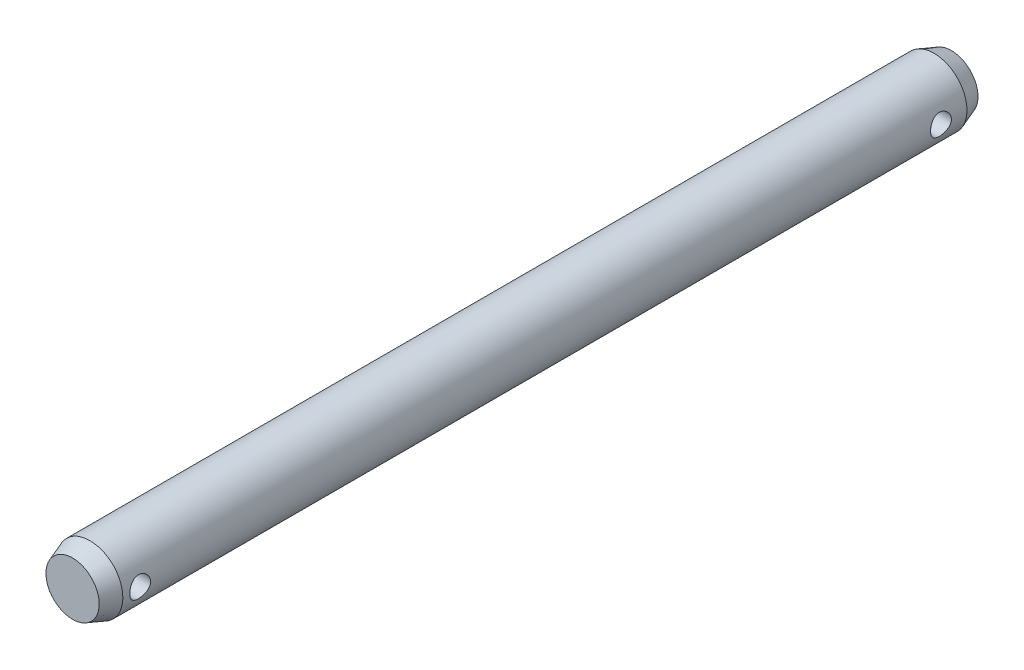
from build123d import *

# Parameters (mm, degrees)
SKETCH1_R          = 4.826
EXTRUDE1_DEPTH     = 64.389
CHAMFER1_SIZE      = 2.54
CHAMFER1_SIZE2     = 0.924484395
CHAMFER2_SIZE      = 2.54
CHAMFER2_SIZE2     = 0.924484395
SKETCH2_R          = 1.524
CUT_EXTRUDE1_DEPTH = 12.7


with BuildPart() as part:
    # Sketch1 → Extrude1 (new, symmetric)
    with BuildSketch(Plane.XY):
        Circle(SKETCH1_R)
    extrude(amount=EXTRUDE1_DEPTH, both=True)

    # Chamfer1
    chamfer1_edges = [part.edges().sort_by_distance(p)[0] for p in [
        (-4.826, 0, 64.389),
    ]]
    chamfer1_side = [part.faces().sort_by_distance(p)[0] for p in [
        (-4.826, 0, 0),
    ]]
    chamfer(chamfer1_edges, length=CHAMFER1_SIZE, length2=CHAMFER1_SIZE2, reference=chamfer1_side[0])

    # Chamfer2
    chamfer2_edges = [part.edges().sort_by_distance(p)[0] for p in [
        (-4.826, 0, -64.389),
    ]]
    chamfer2_side = [part.faces().sort_by_distance(p)[0] for p in [
        (-4.826, 0, -1.27),
    ]]
    chamfer(chamfer2_edges, length=CHAMFER2_SIZE, length2=CHAMFER2_SIZE2, reference=chamfer2_side[0])

    # Sketch2 → Cut-Extrude1 (cut, symmetric)
    with BuildSketch(Plane(origin=(0, 0, 0), x_dir=(0, 0, -1), z_dir=(1, 0, 0))):
        with Locations(Location((-59.309, 0, 0), (0, 0, 179.999999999))):
            Circle(SKETCH2_R)
        with Locations(Location((58.039, 0, 0), (0, 0, 179.999999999))):
            Circle(SKETCH2_R)
    extrude(amount=CUT_EXTRUDE1_DEPTH, both=True, mode=Mode.SUBTRACT)


solid = part.part
